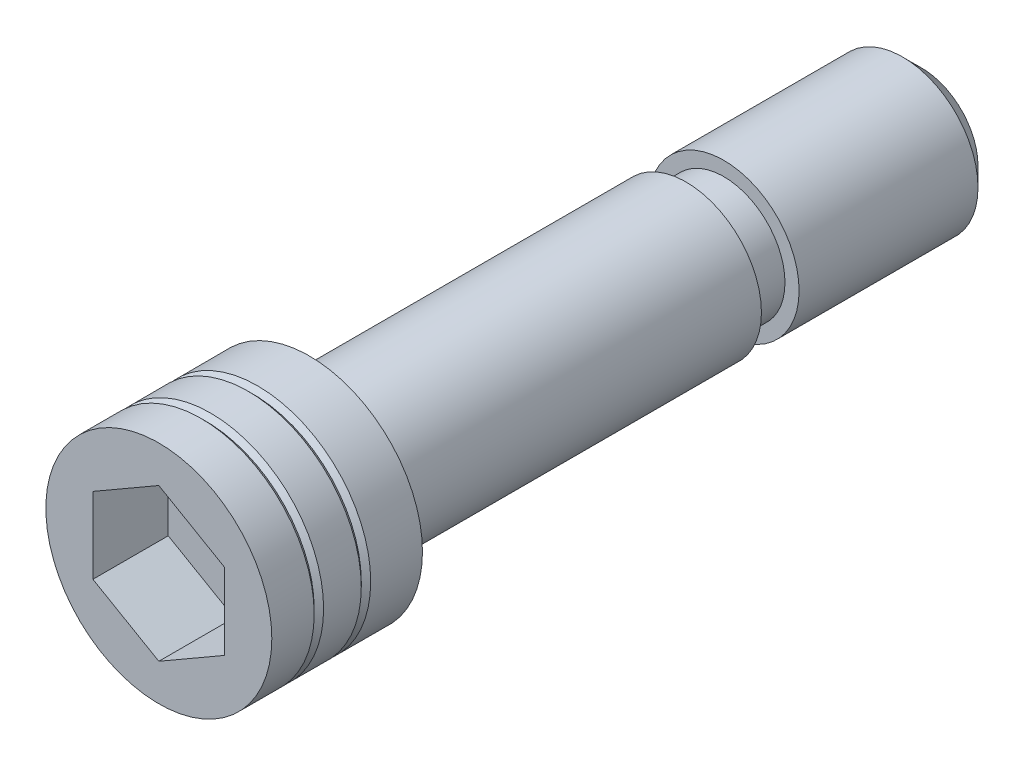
ISO-10303-21;
HEADER;
FILE_DESCRIPTION(('STEP AP214'),'2;1');
FILE_NAME('part.step','',(''),(''),'','','');
FILE_SCHEMA(('AUTOMOTIVE_DESIGN { 1 0 10303 214 1 1 1 1 }'));
ENDSEC;
DATA;
#1=APPLICATION_CONTEXT('core data for automotive mechanical design processes');
#2=APPLICATION_PROTOCOL_DEFINITION('international standard','automotive_design',2000,#1);
#3=PRODUCT_CONTEXT('',#1,'mechanical');
#4=PRODUCT('Part','Part','',(#3));
#5=PRODUCT_RELATED_PRODUCT_CATEGORY('part','',(#4));
#6=PRODUCT_DEFINITION_FORMATION('','',#4);
#7=PRODUCT_DEFINITION_CONTEXT('part definition',#1,'design');
#8=PRODUCT_DEFINITION('design','',#6,#7);
#9=PRODUCT_DEFINITION_SHAPE('','',#8);
#10=(LENGTH_UNIT() NAMED_UNIT(*) SI_UNIT(.MILLI.,.METRE.));
#11=(NAMED_UNIT(*) PLANE_ANGLE_UNIT() SI_UNIT($,.RADIAN.));
#12=(NAMED_UNIT(*) SI_UNIT($,.STERADIAN.) SOLID_ANGLE_UNIT());
#13=UNCERTAINTY_MEASURE_WITH_UNIT(LENGTH_MEASURE(1.E-05),#10,'distance_accuracy_value','');
#14=(GEOMETRIC_REPRESENTATION_CONTEXT(3) GLOBAL_UNCERTAINTY_ASSIGNED_CONTEXT((#13)) GLOBAL_UNIT_ASSIGNED_CONTEXT((#10,
#11,#12)) REPRESENTATION_CONTEXT('',''));
#15=CARTESIAN_POINT('',(0.,0.,0.));
#16=DIRECTION('',(0.,0.,1.));
#17=DIRECTION('',(1.,0.,0.));
#18=AXIS2_PLACEMENT_3D('',#15,#16,#17);
#19=CARTESIAN_POINT('',(0.,0.,15.));
#20=DIRECTION('',(0.,0.,1.));
#21=DIRECTION('',(1.,0.,0.));
#22=AXIS2_PLACEMENT_3D('',#19,#20,#21);
#23=CYLINDRICAL_SURFACE('',#22,12.);
#24=CARTESIAN_POINT('',(0.,0.,0.));
#25=DIRECTION('',(0.,0.,1.));
#26=DIRECTION('',(1.,0.,0.));
#27=AXIS2_PLACEMENT_3D('',#24,#25,#26);
#28=CIRCLE('',#27,12.);
#29=CARTESIAN_POINT('',(12.,0.,0.));
#30=VERTEX_POINT('',#29);
#31=EDGE_CURVE('E23',#30,#30,#28,.T.);
#32=ORIENTED_EDGE('',*,*,#31,.T.);
#33=EDGE_LOOP('',(#32));
#34=FACE_BOUND('',#33,.T.);
#35=CARTESIAN_POINT('',(0.,0.,5.5));
#36=DIRECTION('',(0.,0.,-1.));
#37=DIRECTION('',(-1.,0.,0.));
#38=AXIS2_PLACEMENT_3D('',#35,#36,#37);
#39=CIRCLE('',#38,12.);
#40=CARTESIAN_POINT('',(-12.,0.,5.5));
#41=VERTEX_POINT('',#40);
#42=EDGE_CURVE('E18',#41,#41,#39,.F.);
#43=ORIENTED_EDGE('',*,*,#42,.F.);
#44=EDGE_LOOP('',(#43));
#45=FACE_BOUND('',#44,.T.);
#46=ADVANCED_FACE('F14',(#34,#45),#23,.T.);
#47=CARTESIAN_POINT('',(-8.,0.,0.));
#48=DIRECTION('',(0.,0.,1.));
#49=DIRECTION('',(1.,0.,0.));
#50=AXIS2_PLACEMENT_3D('',#47,#48,#49);
#51=PLANE('',#50);
#52=ORIENTED_EDGE('',*,*,#31,.F.);
#53=EDGE_LOOP('',(#52));
#54=FACE_BOUND('',#53,.T.);
#55=CARTESIAN_POINT('',(0.,0.,0.));
#56=DIRECTION('',(0.,0.,1.));
#57=DIRECTION('',(1.,0.,0.));
#58=AXIS2_PLACEMENT_3D('',#55,#56,#57);
#59=CIRCLE('',#58,8.);
#60=CARTESIAN_POINT('',(8.,0.,0.));
#61=VERTEX_POINT('',#60);
#62=EDGE_CURVE('E142',#61,#61,#59,.T.);
#63=ORIENTED_EDGE('',*,*,#62,.T.);
#64=EDGE_LOOP('',(#63));
#65=FACE_BOUND('',#64,.T.);
#66=ADVANCED_FACE('F187',(#54,#65),#51,.F.);
#67=CARTESIAN_POINT('',(0.,0.,15.));
#68=DIRECTION('',(0.,0.,1.));
#69=DIRECTION('',(1.,0.,0.));
#70=AXIS2_PLACEMENT_3D('',#67,#68,#69);
#71=CYLINDRICAL_SURFACE('',#70,8.);
#72=ORIENTED_EDGE('',*,*,#62,.F.);
#73=EDGE_LOOP('',(#72));
#74=FACE_BOUND('',#73,.T.);
#75=CARTESIAN_POINT('',(0.,0.,-40.));
#76=DIRECTION('',(0.,0.,1.));
#77=DIRECTION('',(1.,0.,0.));
#78=AXIS2_PLACEMENT_3D('',#75,#76,#77);
#79=CIRCLE('',#78,8.);
#80=CARTESIAN_POINT('',(8.,0.,-40.));
#81=VERTEX_POINT('',#80);
#82=EDGE_CURVE('E139',#81,#81,#79,.T.);
#83=ORIENTED_EDGE('',*,*,#82,.T.);
#84=EDGE_LOOP('',(#83));
#85=FACE_BOUND('',#84,.T.);
#86=ADVANCED_FACE('F248',(#74,#85),#71,.T.);
#87=CARTESIAN_POINT('',(-6.5,0.,-40.));
#88=DIRECTION('',(0.,0.,1.));
#89=DIRECTION('',(1.,0.,0.));
#90=AXIS2_PLACEMENT_3D('',#87,#88,#89);
#91=PLANE('',#90);
#92=ORIENTED_EDGE('',*,*,#82,.F.);
#93=EDGE_LOOP('',(#92));
#94=FACE_BOUND('',#93,.T.);
#95=CARTESIAN_POINT('',(0.,0.,-40.));
#96=DIRECTION('',(0.,0.,1.));
#97=DIRECTION('',(1.,0.,0.));
#98=AXIS2_PLACEMENT_3D('',#95,#96,#97);
#99=CIRCLE('',#98,6.5);
#100=CARTESIAN_POINT('',(6.5,0.,-40.));
#101=VERTEX_POINT('',#100);
#102=EDGE_CURVE('E136',#101,#101,#99,.T.);
#103=ORIENTED_EDGE('',*,*,#102,.T.);
#104=EDGE_LOOP('',(#103));
#105=FACE_BOUND('',#104,.T.);
#106=ADVANCED_FACE('F244',(#94,#105),#91,.F.);
#107=CARTESIAN_POINT('',(0.,0.,15.));
#108=DIRECTION('',(0.,0.,1.));
#109=DIRECTION('',(1.,0.,0.));
#110=AXIS2_PLACEMENT_3D('',#107,#108,#109);
#111=CYLINDRICAL_SURFACE('',#110,6.5);
#112=ORIENTED_EDGE('',*,*,#102,.F.);
#113=EDGE_LOOP('',(#112));
#114=FACE_BOUND('',#113,.T.);
#115=CARTESIAN_POINT('',(0.,0.,-44.));
#116=DIRECTION('',(0.,0.,1.));
#117=DIRECTION('',(1.,0.,0.));
#118=AXIS2_PLACEMENT_3D('',#115,#116,#117);
#119=CIRCLE('',#118,6.5);
#120=CARTESIAN_POINT('',(6.5,0.,-44.));
#121=VERTEX_POINT('',#120);
#122=EDGE_CURVE('E133',#121,#121,#119,.T.);
#123=ORIENTED_EDGE('',*,*,#122,.T.);
#124=EDGE_LOOP('',(#123));
#125=FACE_BOUND('',#124,.T.);
#126=ADVANCED_FACE('F240',(#114,#125),#111,.T.);
#127=CARTESIAN_POINT('',(-8.,0.,-44.));
#128=DIRECTION('',(0.,0.,-1.));
#129=DIRECTION('',(-1.,0.,0.));
#130=AXIS2_PLACEMENT_3D('',#127,#128,#129);
#131=PLANE('',#130);
#132=ORIENTED_EDGE('',*,*,#122,.F.);
#133=EDGE_LOOP('',(#132));
#134=FACE_BOUND('',#133,.T.);
#135=CARTESIAN_POINT('',(0.,0.,-44.));
#136=DIRECTION('',(0.,0.,1.));
#137=DIRECTION('',(1.,0.,0.));
#138=AXIS2_PLACEMENT_3D('',#135,#136,#137);
#139=CIRCLE('',#138,8.);
#140=CARTESIAN_POINT('',(8.,0.,-44.));
#141=VERTEX_POINT('',#140);
#142=EDGE_CURVE('E130',#141,#141,#139,.T.);
#143=ORIENTED_EDGE('',*,*,#142,.T.);
#144=EDGE_LOOP('',(#143));
#145=FACE_BOUND('',#144,.T.);
#146=ADVANCED_FACE('F236',(#134,#145),#131,.F.);
#147=CARTESIAN_POINT('',(0.,0.,15.));
#148=DIRECTION('',(0.,0.,1.));
#149=DIRECTION('',(1.,0.,0.));
#150=AXIS2_PLACEMENT_3D('',#147,#148,#149);
#151=CYLINDRICAL_SURFACE('',#150,8.);
#152=ORIENTED_EDGE('',*,*,#142,.F.);
#153=EDGE_LOOP('',(#152));
#154=FACE_BOUND('',#153,.T.);
#155=CARTESIAN_POINT('',(0.,0.,-63.));
#156=DIRECTION('',(0.,0.,1.));
#157=DIRECTION('',(1.,0.,0.));
#158=AXIS2_PLACEMENT_3D('',#155,#156,#157);
#159=CIRCLE('',#158,8.);
#160=CARTESIAN_POINT('',(8.,0.,-63.));
#161=VERTEX_POINT('',#160);
#162=EDGE_CURVE('E127',#161,#161,#159,.T.);
#163=ORIENTED_EDGE('',*,*,#162,.T.);
#164=EDGE_LOOP('',(#163));
#165=FACE_BOUND('',#164,.T.);
#166=ADVANCED_FACE('F232',(#154,#165),#151,.T.);
#167=CARTESIAN_POINT('',(0.,0.,-65.));
#168=DIRECTION('',(0.,0.,1.));
#169=DIRECTION('',(1.,0.,0.));
#170=AXIS2_PLACEMENT_3D('',#167,#168,#169);
#171=CONICAL_SURFACE('',#170,6.,0.785398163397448);
#172=ORIENTED_EDGE('',*,*,#162,.F.);
#173=EDGE_LOOP('',(#172));
#174=FACE_BOUND('',#173,.T.);
#175=CARTESIAN_POINT('',(0.,0.,-65.));
#176=DIRECTION('',(0.,0.,1.));
#177=DIRECTION('',(1.,0.,0.));
#178=AXIS2_PLACEMENT_3D('',#175,#176,#177);
#179=CIRCLE('',#178,6.);
#180=CARTESIAN_POINT('',(6.,0.,-65.));
#181=VERTEX_POINT('',#180);
#182=EDGE_CURVE('E118',#181,#181,#179,.T.);
#183=ORIENTED_EDGE('',*,*,#182,.T.);
#184=EDGE_LOOP('',(#183));
#185=FACE_BOUND('',#184,.T.);
#186=ADVANCED_FACE('F228',(#174,#185),#171,.T.);
#187=CARTESIAN_POINT('',(0.,0.,-65.));
#188=DIRECTION('',(0.,0.,1.));
#189=DIRECTION('',(1.,0.,0.));
#190=AXIS2_PLACEMENT_3D('',#187,#188,#189);
#191=PLANE('',#190);
#192=ORIENTED_EDGE('',*,*,#182,.F.);
#193=EDGE_LOOP('',(#192));
#194=FACE_BOUND('',#193,.T.);
#195=ADVANCED_FACE('F224',(#194),#191,.F.);
#196=CARTESIAN_POINT('',(0.,0.,4.16808974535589));
#197=DIRECTION('',(0.,0.,-1.));
#198=DIRECTION('',(-1.,0.,0.));
#199=AXIS2_PLACEMENT_3D('',#196,#197,#198);
#200=CONICAL_SURFACE('',#199,13.3319102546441,0.785398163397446);
#201=CARTESIAN_POINT('',(0.,0.,6.));
#202=DIRECTION('',(0.,0.,-1.));
#203=DIRECTION('',(-1.,0.,0.));
#204=AXIS2_PLACEMENT_3D('',#201,#202,#203);
#205=CIRCLE('',#204,11.5);
#206=CARTESIAN_POINT('',(-11.5,0.,6.));
#207=VERTEX_POINT('',#206);
#208=EDGE_CURVE('E155',#207,#207,#205,.T.);
#209=ORIENTED_EDGE('',*,*,#208,.T.);
#210=EDGE_LOOP('',(#209));
#211=FACE_BOUND('',#210,.T.);
#212=ORIENTED_EDGE('',*,*,#42,.T.);
#213=EDGE_LOOP('',(#212));
#214=FACE_BOUND('',#213,.T.);
#215=ADVANCED_FACE('F227',(#211,#214),#200,.T.);
#216=CARTESIAN_POINT('',(0.,0.,6.));
#217=DIRECTION('',(0.,0.,1.));
#218=DIRECTION('',(1.,0.,0.));
#219=AXIS2_PLACEMENT_3D('',#216,#217,#218);
#220=CONICAL_SURFACE('',#219,11.5,0.785398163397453);
#221=ORIENTED_EDGE('',*,*,#208,.F.);
#222=EDGE_LOOP('',(#221));
#223=FACE_BOUND('',#222,.T.);
#224=CARTESIAN_POINT('',(0.,0.,6.5));
#225=DIRECTION('',(0.,0.,1.));
#226=DIRECTION('',(1.,0.,0.));
#227=AXIS2_PLACEMENT_3D('',#224,#225,#226);
#228=CIRCLE('',#227,12.);
#229=CARTESIAN_POINT('',(12.,0.,6.5));
#230=VERTEX_POINT('',#229);
#231=EDGE_CURVE('E153',#230,#230,#228,.F.);
#232=ORIENTED_EDGE('',*,*,#231,.T.);
#233=EDGE_LOOP('',(#232));
#234=FACE_BOUND('',#233,.T.);
#235=ADVANCED_FACE('F204',(#223,#234),#220,.T.);
#236=CARTESIAN_POINT('',(-7.,12.1243556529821,8.));
#237=DIRECTION('',(0.,0.,1.));
#238=DIRECTION('',(1.,0.,0.));
#239=AXIS2_PLACEMENT_3D('',#236,#237,#238);
#240=PLANE('',#239);
#241=DIRECTION('',(-0.866025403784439,0.5,0.));
#242=VECTOR('',#241,1.);
#243=CARTESIAN_POINT('',(7.,4.04145188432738,8.));
#244=LINE('',#243,#242);
#245=CARTESIAN_POINT('',(7.,4.04145188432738,8.));
#246=VERTEX_POINT('',#245);
#247=CARTESIAN_POINT('',(0.,8.08290376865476,8.));
#248=VERTEX_POINT('',#247);
#249=EDGE_CURVE('E102',#246,#248,#244,.T.);
#250=ORIENTED_EDGE('',*,*,#249,.T.);
#251=DIRECTION('',(-0.866025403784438,-0.5,0.));
#252=VECTOR('',#251,1.);
#253=CARTESIAN_POINT('',(0.,8.08290376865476,8.));
#254=LINE('',#253,#252);
#255=CARTESIAN_POINT('',(-7.,4.04145188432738,8.));
#256=VERTEX_POINT('',#255);
#257=EDGE_CURVE('E105',#248,#256,#254,.T.);
#258=ORIENTED_EDGE('',*,*,#257,.T.);
#259=DIRECTION('',(0.,-1.,0.));
#260=VECTOR('',#259,1.);
#261=CARTESIAN_POINT('',(-7.,4.04145188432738,8.));
#262=LINE('',#261,#260);
#263=CARTESIAN_POINT('',(-7.,-4.04145188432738,8.));
#264=VERTEX_POINT('',#263);
#265=EDGE_CURVE('E77',#256,#264,#262,.T.);
#266=ORIENTED_EDGE('',*,*,#265,.T.);
#267=DIRECTION('',(0.866025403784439,-0.5,0.));
#268=VECTOR('',#267,1.);
#269=CARTESIAN_POINT('',(-7.,-4.04145188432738,8.));
#270=LINE('',#269,#268);
#271=CARTESIAN_POINT('',(0.,-8.08290376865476,8.));
#272=VERTEX_POINT('',#271);
#273=EDGE_CURVE('E108',#264,#272,#270,.T.);
#274=ORIENTED_EDGE('',*,*,#273,.T.);
#275=DIRECTION('',(0.866025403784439,0.5,0.));
#276=VECTOR('',#275,1.);
#277=CARTESIAN_POINT('',(0.,-8.08290376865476,8.));
#278=LINE('',#277,#276);
#279=CARTESIAN_POINT('',(7.,-4.04145188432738,8.));
#280=VERTEX_POINT('',#279);
#281=EDGE_CURVE('E111',#272,#280,#278,.T.);
#282=ORIENTED_EDGE('',*,*,#281,.T.);
#283=DIRECTION('',(0.,1.,0.));
#284=VECTOR('',#283,1.);
#285=CARTESIAN_POINT('',(7.,-4.04145188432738,8.));
#286=LINE('',#285,#284);
#287=EDGE_CURVE('E114',#280,#246,#286,.T.);
#288=ORIENTED_EDGE('',*,*,#287,.T.);
#289=EDGE_LOOP('',(#250,#258,#266,#274,#282,#288));
#290=FACE_BOUND('',#289,.T.);
#291=ADVANCED_FACE('F201',(#290),#240,.T.);
#292=CARTESIAN_POINT('',(-7.,4.04145188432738,8.));
#293=DIRECTION('',(-1.,0.,0.));
#294=DIRECTION('',(0.,-1.,0.));
#295=AXIS2_PLACEMENT_3D('',#292,#293,#294);
#296=PLANE('',#295);
#297=DIRECTION('',(0.,-1.,0.));
#298=VECTOR('',#297,1.);
#299=CARTESIAN_POINT('',(-7.,4.04145188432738,16.));
#300=LINE('',#299,#298);
#301=CARTESIAN_POINT('',(-7.,4.04145188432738,16.));
#302=VERTEX_POINT('',#301);
#303=CARTESIAN_POINT('',(-7.,-4.04145188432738,16.));
#304=VERTEX_POINT('',#303);
#305=EDGE_CURVE('E74',#302,#304,#300,.T.);
#306=ORIENTED_EDGE('',*,*,#305,.T.);
#307=DIRECTION('',(0.,0.,1.));
#308=VECTOR('',#307,1.);
#309=CARTESIAN_POINT('',(-7.,-4.04145188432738,8.));
#310=LINE('',#309,#308);
#311=EDGE_CURVE('E81',#264,#304,#310,.T.);
#312=ORIENTED_EDGE('',*,*,#311,.F.);
#313=ORIENTED_EDGE('',*,*,#265,.F.);
#314=DIRECTION('',(0.,0.,1.));
#315=VECTOR('',#314,1.);
#316=CARTESIAN_POINT('',(-7.,4.04145188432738,8.));
#317=LINE('',#316,#315);
#318=EDGE_CURVE('E70',#256,#302,#317,.T.);
#319=ORIENTED_EDGE('',*,*,#318,.T.);
#320=EDGE_LOOP('',(#306,#312,#313,#319));
#321=FACE_BOUND('',#320,.T.);
#322=ADVANCED_FACE('F72',(#321),#296,.F.);
#323=CARTESIAN_POINT('',(-7.,-4.04145188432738,8.));
#324=DIRECTION('',(-0.5,-0.866025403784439,0.));
#325=DIRECTION('',(0.866025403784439,-0.5,0.));
#326=AXIS2_PLACEMENT_3D('',#323,#324,#325);
#327=PLANE('',#326);
#328=DIRECTION('',(0.866025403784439,-0.5,0.));
#329=VECTOR('',#328,1.);
#330=CARTESIAN_POINT('',(-7.,-4.04145188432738,16.));
#331=LINE('',#330,#329);
#332=CARTESIAN_POINT('',(0.,-8.08290376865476,16.));
#333=VERTEX_POINT('',#332);
#334=EDGE_CURVE('E92',#304,#333,#331,.T.);
#335=ORIENTED_EDGE('',*,*,#334,.T.);
#336=DIRECTION('',(0.,0.,1.));
#337=VECTOR('',#336,1.);
#338=CARTESIAN_POINT('',(0.,-8.08290376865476,8.));
#339=LINE('',#338,#337);
#340=EDGE_CURVE('E121',#272,#333,#339,.T.);
#341=ORIENTED_EDGE('',*,*,#340,.F.);
#342=ORIENTED_EDGE('',*,*,#273,.F.);
#343=ORIENTED_EDGE('',*,*,#311,.T.);
#344=EDGE_LOOP('',(#335,#341,#342,#343));
#345=FACE_BOUND('',#344,.T.);
#346=ADVANCED_FACE('F213',(#345),#327,.F.);
#347=CARTESIAN_POINT('',(0.,-8.08290376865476,8.));
#348=DIRECTION('',(0.5,-0.866025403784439,0.));
#349=DIRECTION('',(0.866025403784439,0.5,0.));
#350=AXIS2_PLACEMENT_3D('',#347,#348,#349);
#351=PLANE('',#350);
#352=DIRECTION('',(0.866025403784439,0.5,0.));
#353=VECTOR('',#352,1.);
#354=CARTESIAN_POINT('',(0.,-8.08290376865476,16.));
#355=LINE('',#354,#353);
#356=CARTESIAN_POINT('',(7.,-4.04145188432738,16.));
#357=VERTEX_POINT('',#356);
#358=EDGE_CURVE('E94',#333,#357,#355,.T.);
#359=ORIENTED_EDGE('',*,*,#358,.T.);
#360=DIRECTION('',(0.,0.,1.));
#361=VECTOR('',#360,1.);
#362=CARTESIAN_POINT('',(7.,-4.04145188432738,8.));
#363=LINE('',#362,#361);
#364=EDGE_CURVE('E119',#280,#357,#363,.T.);
#365=ORIENTED_EDGE('',*,*,#364,.F.);
#366=ORIENTED_EDGE('',*,*,#281,.F.);
#367=ORIENTED_EDGE('',*,*,#340,.T.);
#368=EDGE_LOOP('',(#359,#365,#366,#367));
#369=FACE_BOUND('',#368,.T.);
#370=ADVANCED_FACE('F210',(#369),#351,.F.);
#371=CARTESIAN_POINT('',(7.,-4.04145188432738,8.));
#372=DIRECTION('',(1.,0.,0.));
#373=DIRECTION('',(0.,1.,0.));
#374=AXIS2_PLACEMENT_3D('',#371,#372,#373);
#375=PLANE('',#374);
#376=DIRECTION('',(0.,1.,0.));
#377=VECTOR('',#376,1.);
#378=CARTESIAN_POINT('',(7.,-4.04145188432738,16.));
#379=LINE('',#378,#377);
#380=CARTESIAN_POINT('',(7.,4.04145188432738,16.));
#381=VERTEX_POINT('',#380);
#382=EDGE_CURVE('E100',#357,#381,#379,.T.);
#383=ORIENTED_EDGE('',*,*,#382,.T.);
#384=DIRECTION('',(0.,0.,1.));
#385=VECTOR('',#384,1.);
#386=CARTESIAN_POINT('',(7.,4.04145188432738,8.));
#387=LINE('',#386,#385);
#388=EDGE_CURVE('E38',#246,#381,#387,.T.);
#389=ORIENTED_EDGE('',*,*,#388,.F.);
#390=ORIENTED_EDGE('',*,*,#287,.F.);
#391=ORIENTED_EDGE('',*,*,#364,.T.);
#392=EDGE_LOOP('',(#383,#389,#390,#391));
#393=FACE_BOUND('',#392,.T.);
#394=ADVANCED_FACE('F206',(#393),#375,.F.);
#395=CARTESIAN_POINT('',(7.,4.04145188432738,8.));
#396=DIRECTION('',(0.5,0.866025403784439,0.));
#397=DIRECTION('',(-0.866025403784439,0.5,0.));
#398=AXIS2_PLACEMENT_3D('',#395,#396,#397);
#399=PLANE('',#398);
#400=DIRECTION('',(-0.866025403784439,0.5,0.));
#401=VECTOR('',#400,1.);
#402=CARTESIAN_POINT('',(7.,4.04145188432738,16.));
#403=LINE('',#402,#401);
#404=CARTESIAN_POINT('',(0.,8.08290376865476,16.));
#405=VERTEX_POINT('',#404);
#406=EDGE_CURVE('E31',#381,#405,#403,.T.);
#407=ORIENTED_EDGE('',*,*,#406,.T.);
#408=DIRECTION('',(0.,0.,1.));
#409=VECTOR('',#408,1.);
#410=CARTESIAN_POINT('',(0.,8.08290376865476,8.));
#411=LINE('',#410,#409);
#412=EDGE_CURVE('E82',#248,#405,#411,.T.);
#413=ORIENTED_EDGE('',*,*,#412,.F.);
#414=ORIENTED_EDGE('',*,*,#249,.F.);
#415=ORIENTED_EDGE('',*,*,#388,.T.);
#416=EDGE_LOOP('',(#407,#413,#414,#415));
#417=FACE_BOUND('',#416,.T.);
#418=ADVANCED_FACE('F209',(#417),#399,.F.);
#419=CARTESIAN_POINT('',(0.,8.08290376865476,8.));
#420=DIRECTION('',(-0.5,0.866025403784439,0.));
#421=DIRECTION('',(-0.866025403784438,-0.5,0.));
#422=AXIS2_PLACEMENT_3D('',#419,#420,#421);
#423=PLANE('',#422);
#424=DIRECTION('',(-0.866025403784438,-0.5,0.));
#425=VECTOR('',#424,1.);
#426=CARTESIAN_POINT('',(0.,8.08290376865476,16.));
#427=LINE('',#426,#425);
#428=EDGE_CURVE('E85',#405,#302,#427,.T.);
#429=ORIENTED_EDGE('',*,*,#428,.T.);
#430=ORIENTED_EDGE('',*,*,#318,.F.);
#431=ORIENTED_EDGE('',*,*,#257,.F.);
#432=ORIENTED_EDGE('',*,*,#412,.T.);
#433=EDGE_LOOP('',(#429,#430,#431,#432));
#434=FACE_BOUND('',#433,.T.);
#435=ADVANCED_FACE('F86',(#434),#423,.F.);
#436=CARTESIAN_POINT('',(-12.,0.,16.));
#437=DIRECTION('',(0.,0.,-1.));
#438=DIRECTION('',(-1.,0.,0.));
#439=AXIS2_PLACEMENT_3D('',#436,#437,#438);
#440=PLANE('',#439);
#441=ORIENTED_EDGE('',*,*,#428,.F.);
#442=ORIENTED_EDGE('',*,*,#406,.F.);
#443=ORIENTED_EDGE('',*,*,#382,.F.);
#444=ORIENTED_EDGE('',*,*,#358,.F.);
#445=ORIENTED_EDGE('',*,*,#334,.F.);
#446=ORIENTED_EDGE('',*,*,#305,.F.);
#447=EDGE_LOOP('',(#441,#442,#443,#444,#445,#446));
#448=FACE_BOUND('',#447,.T.);
#449=CARTESIAN_POINT('',(0.,0.,16.));
#450=DIRECTION('',(0.,0.,1.));
#451=DIRECTION('',(1.,0.,0.));
#452=AXIS2_PLACEMENT_3D('',#449,#450,#451);
#453=CIRCLE('',#452,12.);
#454=CARTESIAN_POINT('',(12.,0.,16.));
#455=VERTEX_POINT('',#454);
#456=EDGE_CURVE('E9',#455,#455,#453,.T.);
#457=ORIENTED_EDGE('',*,*,#456,.T.);
#458=EDGE_LOOP('',(#457));
#459=FACE_BOUND('',#458,.T.);
#460=ADVANCED_FACE('F16',(#448,#459),#440,.F.);
#461=ORIENTED_EDGE('',*,*,#456,.F.);
#462=EDGE_LOOP('',(#461));
#463=FACE_BOUND('',#462,.T.);
#464=CARTESIAN_POINT('',(0.,0.,11.5));
#465=DIRECTION('',(0.,0.,1.));
#466=DIRECTION('',(1.,0.,0.));
#467=AXIS2_PLACEMENT_3D('',#464,#465,#466);
#468=CIRCLE('',#467,12.);
#469=CARTESIAN_POINT('',(12.,0.,11.5));
#470=VERTEX_POINT('',#469);
#471=EDGE_CURVE('E147',#470,#470,#468,.F.);
#472=ORIENTED_EDGE('',*,*,#471,.F.);
#473=EDGE_LOOP('',(#472));
#474=FACE_BOUND('',#473,.T.);
#475=ADVANCED_FACE('F173',(#463,#474),#23,.T.);
#476=CARTESIAN_POINT('',(0.,0.,11.));
#477=DIRECTION('',(0.,0.,1.));
#478=DIRECTION('',(1.,0.,0.));
#479=AXIS2_PLACEMENT_3D('',#476,#477,#478);
#480=CONICAL_SURFACE('',#479,11.5,0.785398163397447);
#481=CARTESIAN_POINT('',(0.,0.,11.));
#482=DIRECTION('',(0.,0.,-1.));
#483=DIRECTION('',(-1.,0.,0.));
#484=AXIS2_PLACEMENT_3D('',#481,#482,#483);
#485=CIRCLE('',#484,11.5);
#486=CARTESIAN_POINT('',(-11.5,0.,11.));
#487=VERTEX_POINT('',#486);
#488=EDGE_CURVE('E151',#487,#487,#485,.T.);
#489=ORIENTED_EDGE('',*,*,#488,.F.);
#490=EDGE_LOOP('',(#489));
#491=FACE_BOUND('',#490,.T.);
#492=ORIENTED_EDGE('',*,*,#471,.T.);
#493=EDGE_LOOP('',(#492));
#494=FACE_BOUND('',#493,.T.);
#495=ADVANCED_FACE('F170',(#491,#494),#480,.T.);
#496=CARTESIAN_POINT('',(0.,0.,9.16808974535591));
#497=DIRECTION('',(0.,0.,-1.));
#498=DIRECTION('',(-1.,0.,0.));
#499=AXIS2_PLACEMENT_3D('',#496,#497,#498);
#500=CONICAL_SURFACE('',#499,13.3319102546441,0.785398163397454);
#501=ORIENTED_EDGE('',*,*,#488,.T.);
#502=EDGE_LOOP('',(#501));
#503=FACE_BOUND('',#502,.T.);
#504=CARTESIAN_POINT('',(0.,0.,10.5));
#505=DIRECTION('',(0.,0.,-1.));
#506=DIRECTION('',(-1.,0.,0.));
#507=AXIS2_PLACEMENT_3D('',#504,#505,#506);
#508=CIRCLE('',#507,12.);
#509=CARTESIAN_POINT('',(-12.,0.,10.5));
#510=VERTEX_POINT('',#509);
#511=EDGE_CURVE('E150',#510,#510,#508,.F.);
#512=ORIENTED_EDGE('',*,*,#511,.T.);
#513=EDGE_LOOP('',(#512));
#514=FACE_BOUND('',#513,.T.);
#515=ADVANCED_FACE('F167',(#503,#514),#500,.T.);
#516=ORIENTED_EDGE('',*,*,#511,.F.);
#517=EDGE_LOOP('',(#516));
#518=FACE_BOUND('',#517,.T.);
#519=ORIENTED_EDGE('',*,*,#231,.F.);
#520=EDGE_LOOP('',(#519));
#521=FACE_BOUND('',#520,.T.);
#522=ADVANCED_FACE('F179',(#518,#521),#23,.T.);
#523=CLOSED_SHELL('',(#46,#66,#86,#106,#126,#146,#166,#186,#195,#215,#235,#291,#322,#346,#370,
#394,#418,#435,#460,#475,#495,#515,#522));
#524=MANIFOLD_SOLID_BREP('B1',#523);
#525=ADVANCED_BREP_SHAPE_REPRESENTATION('',(#18,#524),#14);
#526=SHAPE_DEFINITION_REPRESENTATION(#9,#525);
ENDSEC;
END-ISO-10303-21;
